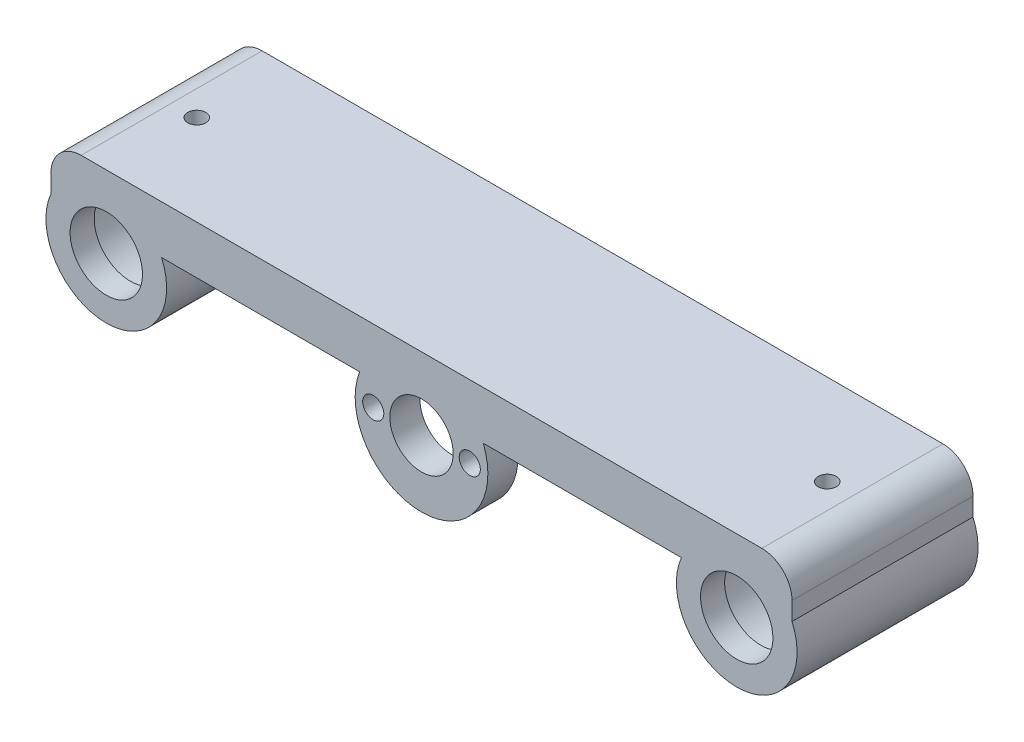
ISO-10303-21;
HEADER;
FILE_DESCRIPTION(('STEP AP214'),'2;1');
FILE_NAME('part.step','',(''),(''),'','','');
FILE_SCHEMA(('AUTOMOTIVE_DESIGN { 1 0 10303 214 1 1 1 1 }'));
ENDSEC;
DATA;
#1=APPLICATION_CONTEXT('core data for automotive mechanical design processes');
#2=APPLICATION_PROTOCOL_DEFINITION('international standard','automotive_design',2000,#1);
#3=PRODUCT_CONTEXT('',#1,'mechanical');
#4=PRODUCT('Part','Part','',(#3));
#5=PRODUCT_RELATED_PRODUCT_CATEGORY('part','',(#4));
#6=PRODUCT_DEFINITION_FORMATION('','',#4);
#7=PRODUCT_DEFINITION_CONTEXT('part definition',#1,'design');
#8=PRODUCT_DEFINITION('design','',#6,#7);
#9=PRODUCT_DEFINITION_SHAPE('','',#8);
#10=(LENGTH_UNIT() NAMED_UNIT(*) SI_UNIT(.MILLI.,.METRE.));
#11=(NAMED_UNIT(*) PLANE_ANGLE_UNIT() SI_UNIT($,.RADIAN.));
#12=(NAMED_UNIT(*) SI_UNIT($,.STERADIAN.) SOLID_ANGLE_UNIT());
#13=UNCERTAINTY_MEASURE_WITH_UNIT(LENGTH_MEASURE(1.E-05),#10,'distance_accuracy_value','');
#14=(GEOMETRIC_REPRESENTATION_CONTEXT(3) GLOBAL_UNCERTAINTY_ASSIGNED_CONTEXT((#13)) GLOBAL_UNIT_ASSIGNED_CONTEXT((#10,
#11,#12)) REPRESENTATION_CONTEXT('',''));
#15=CARTESIAN_POINT('',(0.,0.,0.));
#16=DIRECTION('',(0.,0.,1.));
#17=DIRECTION('',(1.,0.,0.));
#18=AXIS2_PLACEMENT_3D('',#15,#16,#17);
#19=CARTESIAN_POINT('',(52.25,0.,30.));
#20=DIRECTION('',(0.,0.,-1.));
#21=DIRECTION('',(-1.,0.,0.));
#22=AXIS2_PLACEMENT_3D('',#19,#20,#21);
#23=CYLINDRICAL_SURFACE('',#22,11.);
#24=CARTESIAN_POINT('',(52.25,0.,25.));
#25=DIRECTION('',(0.,0.,-1.));
#26=DIRECTION('',(-1.,0.,0.));
#27=AXIS2_PLACEMENT_3D('',#24,#25,#26);
#28=CIRCLE('',#27,11.);
#29=CARTESIAN_POINT('',(62.4969507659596,4.,25.));
#30=VERTEX_POINT('',#29);
#31=CARTESIAN_POINT('',(42.0030492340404,4.,25.));
#32=VERTEX_POINT('',#31);
#33=EDGE_CURVE('E132',#30,#32,#28,.T.);
#34=ORIENTED_EDGE('',*,*,#33,.F.);
#35=DIRECTION('',(0.,0.,-1.));
#36=VECTOR('',#35,1.);
#37=CARTESIAN_POINT('',(62.4969507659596,4.,30.));
#38=LINE('',#37,#36);
#39=CARTESIAN_POINT('',(62.4969507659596,4.,30.));
#40=VERTEX_POINT('',#39);
#41=EDGE_CURVE('E155',#40,#30,#38,.T.);
#42=ORIENTED_EDGE('',*,*,#41,.F.);
#43=CARTESIAN_POINT('',(52.25,0.,30.));
#44=DIRECTION('',(0.,0.,1.));
#45=DIRECTION('',(1.,0.,0.));
#46=AXIS2_PLACEMENT_3D('',#43,#44,#45);
#47=CIRCLE('',#46,11.);
#48=CARTESIAN_POINT('',(42.0030492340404,4.,30.));
#49=VERTEX_POINT('',#48);
#50=EDGE_CURVE('E153',#49,#40,#47,.T.);
#51=ORIENTED_EDGE('',*,*,#50,.F.);
#52=DIRECTION('',(0.,0.,-1.));
#53=VECTOR('',#52,1.);
#54=CARTESIAN_POINT('',(42.0030492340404,4.,30.));
#55=LINE('',#54,#53);
#56=EDGE_CURVE('E148',#49,#32,#55,.T.);
#57=ORIENTED_EDGE('',*,*,#56,.T.);
#58=EDGE_LOOP('',(#34,#42,#51,#57));
#59=FACE_BOUND('',#58,.T.);
#60=ADVANCED_FACE('F39',(#59),#23,.T.);
#61=CARTESIAN_POINT('',(60.25,0.,30.));
#62=DIRECTION('',(0.,0.,-1.));
#63=DIRECTION('',(-1.,0.,0.));
#64=AXIS2_PLACEMENT_3D('',#61,#62,#63);
#65=CYLINDRICAL_SURFACE('',#64,1.75);
#66=CARTESIAN_POINT('',(60.25,0.,30.));
#67=DIRECTION('',(0.,0.,1.));
#68=DIRECTION('',(1.,0.,0.));
#69=AXIS2_PLACEMENT_3D('',#66,#67,#68);
#70=CIRCLE('',#69,1.75);
#71=CARTESIAN_POINT('',(62.,0.,30.));
#72=VERTEX_POINT('',#71);
#73=EDGE_CURVE('E234',#72,#72,#70,.T.);
#74=ORIENTED_EDGE('',*,*,#73,.T.);
#75=EDGE_LOOP('',(#74));
#76=FACE_BOUND('',#75,.T.);
#77=CARTESIAN_POINT('',(60.25,0.,25.));
#78=DIRECTION('',(0.,0.,-1.));
#79=DIRECTION('',(-1.,0.,0.));
#80=AXIS2_PLACEMENT_3D('',#77,#78,#79);
#81=CIRCLE('',#80,1.75);
#82=CARTESIAN_POINT('',(58.5,0.,25.));
#83=VERTEX_POINT('',#82);
#84=EDGE_CURVE('E297',#83,#83,#81,.T.);
#85=ORIENTED_EDGE('',*,*,#84,.T.);
#86=EDGE_LOOP('',(#85));
#87=FACE_BOUND('',#86,.T.);
#88=ADVANCED_FACE('F348',(#76,#87),#65,.F.);
#89=CARTESIAN_POINT('',(44.25,0.,30.));
#90=DIRECTION('',(0.,0.,-1.));
#91=DIRECTION('',(-1.,0.,0.));
#92=AXIS2_PLACEMENT_3D('',#89,#90,#91);
#93=CYLINDRICAL_SURFACE('',#92,1.75);
#94=CARTESIAN_POINT('',(44.25,0.,30.));
#95=DIRECTION('',(0.,0.,1.));
#96=DIRECTION('',(1.,0.,0.));
#97=AXIS2_PLACEMENT_3D('',#94,#95,#96);
#98=CIRCLE('',#97,1.75);
#99=CARTESIAN_POINT('',(46.,0.,30.));
#100=VERTEX_POINT('',#99);
#101=EDGE_CURVE('E229',#100,#100,#98,.T.);
#102=ORIENTED_EDGE('',*,*,#101,.T.);
#103=EDGE_LOOP('',(#102));
#104=FACE_BOUND('',#103,.T.);
#105=CARTESIAN_POINT('',(44.25,0.,25.));
#106=DIRECTION('',(0.,0.,-1.));
#107=DIRECTION('',(-1.,0.,0.));
#108=AXIS2_PLACEMENT_3D('',#105,#106,#107);
#109=CIRCLE('',#108,1.75);
#110=CARTESIAN_POINT('',(42.5,0.,25.));
#111=VERTEX_POINT('',#110);
#112=EDGE_CURVE('E43',#111,#111,#109,.T.);
#113=ORIENTED_EDGE('',*,*,#112,.T.);
#114=EDGE_LOOP('',(#113));
#115=FACE_BOUND('',#114,.T.);
#116=ADVANCED_FACE('F353',(#104,#115),#93,.F.);
#117=CARTESIAN_POINT('',(104.5,0.,30.));
#118=DIRECTION('',(0.,0.,-1.));
#119=DIRECTION('',(-1.,0.,0.));
#120=AXIS2_PLACEMENT_3D('',#117,#118,#119);
#121=CYLINDRICAL_SURFACE('',#120,7.75);
#122=CARTESIAN_POINT('',(104.5,7.75,16.5));
#123=CARTESIAN_POINT('',(104.583421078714,7.74999847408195,16.4999968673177));
#124=CARTESIAN_POINT('',(104.666882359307,7.74863921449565,16.4930174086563));
#125=CARTESIAN_POINT('',(104.831449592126,7.74334791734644,16.4653039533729));
#126=CARTESIAN_POINT('',(104.912553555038,7.73941376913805,16.4445586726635));
#127=CARTESIAN_POINT('',(105.070002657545,7.72941240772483,16.3899753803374));
#128=CARTESIAN_POINT('',(105.146352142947,7.7233471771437,16.3561495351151));
#129=CARTESIAN_POINT('',(105.292285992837,7.70974455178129,16.2764006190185));
#130=CARTESIAN_POINT('',(105.361870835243,7.70220726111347,16.2304784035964));
#131=CARTESIAN_POINT('',(105.493191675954,7.6863840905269,16.1272204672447));
#132=CARTESIAN_POINT('',(105.554829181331,7.67809065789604,16.0697606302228));
#133=CARTESIAN_POINT('',(105.667653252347,7.66174545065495,15.9453254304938));
#134=CARTESIAN_POINT('',(105.718839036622,7.65369369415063,15.8783493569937));
#135=CARTESIAN_POINT('',(105.80972091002,7.63866991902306,15.7360809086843));
#136=CARTESIAN_POINT('',(105.849315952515,7.63170762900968,15.6607228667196));
#137=CARTESIAN_POINT('',(105.915245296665,7.61975791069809,15.5042668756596));
#138=CARTESIAN_POINT('',(105.941580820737,7.6147703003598,15.4231694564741));
#139=CARTESIAN_POINT('',(105.97992571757,7.60741086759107,15.2585934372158));
#140=CARTESIAN_POINT('',(105.992107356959,7.60500761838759,15.1751564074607));
#141=CARTESIAN_POINT('',(106.002333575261,7.60299433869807,15.0073908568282));
#142=CARTESIAN_POINT('',(106.000379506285,7.60338404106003,14.923062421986));
#143=CARTESIAN_POINT('',(105.982529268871,7.60688404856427,14.7571617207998));
#144=CARTESIAN_POINT('',(105.966829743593,7.60995597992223,14.6755673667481));
#145=CARTESIAN_POINT('',(105.92224426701,7.61841397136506,14.516192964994));
#146=CARTESIAN_POINT('',(105.893357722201,7.62380013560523,14.4384130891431));
#147=CARTESIAN_POINT('',(105.823028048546,7.63631940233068,14.2883042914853));
#148=CARTESIAN_POINT('',(105.781506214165,7.64346339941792,14.2160131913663));
#149=CARTESIAN_POINT('',(105.687140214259,7.65868628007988,14.0793505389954));
#150=CARTESIAN_POINT('',(105.634294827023,7.66676526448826,14.0149798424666));
#151=CARTESIAN_POINT('',(105.517725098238,7.68311457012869,13.8948497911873));
#152=CARTESIAN_POINT('',(105.453832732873,7.6913858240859,13.8392534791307));
#153=CARTESIAN_POINT('',(105.317543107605,7.70706304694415,13.7395427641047));
#154=CARTESIAN_POINT('',(105.245145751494,7.71446900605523,13.6954284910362));
#155=CARTESIAN_POINT('',(105.093725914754,7.72759765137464,13.6199071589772));
#156=CARTESIAN_POINT('',(105.014694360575,7.73331798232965,13.5885178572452));
#157=CARTESIAN_POINT('',(104.852344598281,7.74241280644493,13.5395066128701));
#158=CARTESIAN_POINT('',(104.769026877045,7.74578756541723,13.5218831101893));
#159=CARTESIAN_POINT('',(104.601871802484,7.74977424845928,13.5011325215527));
#160=CARTESIAN_POINT('',(104.518063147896,7.75042872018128,13.4977821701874));
#161=CARTESIAN_POINT('',(104.35108336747,7.74901892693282,13.5050729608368));
#162=CARTESIAN_POINT('',(104.267912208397,7.74695480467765,13.5157133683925));
#163=CARTESIAN_POINT('',(104.105282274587,7.7403663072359,13.5504980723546));
#164=CARTESIAN_POINT('',(104.025798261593,7.73586266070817,13.5745286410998));
#165=CARTESIAN_POINT('',(103.871987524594,7.72489811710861,13.6352878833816));
#166=CARTESIAN_POINT('',(103.797661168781,7.71843708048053,13.6720174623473));
#167=CARTESIAN_POINT('',(103.655328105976,7.7041683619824,13.7576209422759));
#168=CARTESIAN_POINT('',(103.58740437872,7.69634597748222,13.8066303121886));
#169=CARTESIAN_POINT('',(103.460665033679,7.68025855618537,13.9152197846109));
#170=CARTESIAN_POINT('',(103.401850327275,7.67199347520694,13.974800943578));
#171=CARTESIAN_POINT('',(103.294143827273,7.65580995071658,14.103856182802));
#172=CARTESIAN_POINT('',(103.24540483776,7.64789809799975,14.1734587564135));
#173=CARTESIAN_POINT('',(103.160309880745,7.63345275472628,14.3199942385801));
#174=CARTESIAN_POINT('',(103.123953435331,7.62691921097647,14.3969268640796));
#175=CARTESIAN_POINT('',(103.064868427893,7.61602267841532,14.5555629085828));
#176=CARTESIAN_POINT('',(103.042071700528,7.61164885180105,14.6372401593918));
#177=CARTESIAN_POINT('',(103.010544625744,7.60554305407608,14.8033588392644));
#178=CARTESIAN_POINT('',(103.001812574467,7.60381076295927,14.887799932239));
#179=CARTESIAN_POINT('',(102.998722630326,7.60320113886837,15.0555170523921));
#180=CARTESIAN_POINT('',(103.004123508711,7.60427589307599,15.1387885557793));
#181=CARTESIAN_POINT('',(103.028615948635,7.60905263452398,15.3032124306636));
#182=CARTESIAN_POINT('',(103.047707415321,7.61275460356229,15.3843648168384));
#183=CARTESIAN_POINT('',(103.098934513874,7.62234788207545,15.5421057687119));
#184=CARTESIAN_POINT('',(103.13104237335,7.62823452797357,15.6187036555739));
#185=CARTESIAN_POINT('',(103.207363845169,7.64153687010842,15.7654634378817));
#186=CARTESIAN_POINT('',(103.251578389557,7.64895268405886,15.8356248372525));
#187=CARTESIAN_POINT('',(103.351689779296,7.66462550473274,15.9687249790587));
#188=CARTESIAN_POINT('',(103.407761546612,7.67289403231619,16.0315308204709));
#189=CARTESIAN_POINT('',(103.529632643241,7.68925611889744,16.1469221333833));
#190=CARTESIAN_POINT('',(103.595434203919,7.69734963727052,16.1995052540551));
#191=CARTESIAN_POINT('',(103.73566215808,7.71254202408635,16.2934370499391));
#192=CARTESIAN_POINT('',(103.810165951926,7.71963049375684,16.3346719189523));
#193=CARTESIAN_POINT('',(103.965159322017,7.73191220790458,16.4039722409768));
#194=CARTESIAN_POINT('',(104.04564330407,7.73710719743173,16.4320498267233));
#195=CARTESIAN_POINT('',(104.188614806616,7.74398117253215,16.4686625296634));
#196=CARTESIAN_POINT('',(104.250276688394,7.74622526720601,16.4803935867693));
#197=CARTESIAN_POINT('',(104.374618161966,7.74923523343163,16.4960633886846));
#198=CARTESIAN_POINT('',(104.437297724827,7.75000114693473,16.5000023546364));
#199=CARTESIAN_POINT('',(104.5,7.75,16.5));
#200=B_SPLINE_CURVE_WITH_KNOTS('',3,(#122,#123,#124,#125,#126,#127,#128,#129,#130,#131,#132,
#133,#134,#135,#136,#137,#138,#139,#140,#141,#142,#143,#144,#145,#146,#147,#148,#149,#150,#151,
#152,#153,#154,#155,#156,#157,#158,#159,#160,#161,#162,#163,#164,#165,#166,#167,#168,#169,#170,
#171,#172,#173,#174,#175,#176,#177,#178,#179,#180,#181,#182,#183,#184,#185,#186,#187,#188,#189,
#190,#191,#192,#193,#194,#195,#196,#197,#198,#199),.UNSPECIFIED.,.T.,.F.,(4,2,2,2,2,2,2,2,2,2,2,
2,2,2,2,2,2,2,2,2,2,2,2,2,2,2,2,2,2,2,2,2,2,2,2,2,2,2,4),(0.,0.250033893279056,0.50027299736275,
0.750279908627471,1.00026914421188,1.25310753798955,1.5059648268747,1.76096497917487,
2.01594161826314,2.26778131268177,2.51959691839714,2.76786784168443,3.01614993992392,
3.26601139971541,3.51589983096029,3.7699911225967,4.02408528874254,4.27853282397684,
4.53295151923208,4.78337555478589,5.03378644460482,5.28210222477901,5.53043571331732,
5.78163969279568,6.03286878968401,6.28766619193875,6.5424537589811,6.7959494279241,
7.04941438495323,7.29858139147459,7.54774667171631,7.79638309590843,8.045038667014,
8.29765636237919,8.5503320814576,8.80545637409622,9.06034494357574,9.24828472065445,
9.43621916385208),.UNSPECIFIED.);
#201=CARTESIAN_POINT('',(104.5,7.75,16.5));
#202=VERTEX_POINT('',#201);
#203=EDGE_CURVE('E270',#202,#202,#200,.T.);
#204=ORIENTED_EDGE('',*,*,#203,.T.);
#205=EDGE_LOOP('',(#204));
#206=FACE_BOUND('',#205,.T.);
#207=CARTESIAN_POINT('',(104.5,0.,0.));
#208=DIRECTION('',(0.,0.,1.));
#209=DIRECTION('',(1.,0.,0.));
#210=AXIS2_PLACEMENT_3D('',#207,#208,#209);
#211=CIRCLE('',#210,7.75);
#212=CARTESIAN_POINT('',(112.25,0.,0.));
#213=VERTEX_POINT('',#212);
#214=EDGE_CURVE('E219',#213,#213,#211,.T.);
#215=ORIENTED_EDGE('',*,*,#214,.F.);
#216=EDGE_LOOP('',(#215));
#217=FACE_BOUND('',#216,.T.);
#218=CARTESIAN_POINT('',(104.5,0.,26.));
#219=DIRECTION('',(0.,0.,1.));
#220=DIRECTION('',(1.,0.,0.));
#221=AXIS2_PLACEMENT_3D('',#218,#219,#220);
#222=CIRCLE('',#221,7.74999999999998);
#223=CARTESIAN_POINT('',(112.25,0.,26.));
#224=VERTEX_POINT('',#223);
#225=EDGE_CURVE('E264',#224,#224,#222,.T.);
#226=ORIENTED_EDGE('',*,*,#225,.T.);
#227=EDGE_LOOP('',(#226));
#228=FACE_BOUND('',#227,.T.);
#229=ADVANCED_FACE('F370',(#206,#217,#228),#121,.F.);
#230=CARTESIAN_POINT('',(0.,0.,30.));
#231=DIRECTION('',(0.,0.,-1.));
#232=DIRECTION('',(-1.,0.,0.));
#233=AXIS2_PLACEMENT_3D('',#230,#231,#232);
#234=CYLINDRICAL_SURFACE('',#233,7.75);
#235=CARTESIAN_POINT('',(0.,7.75,16.5));
#236=CARTESIAN_POINT('',(0.0834210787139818,7.74999847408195,16.4999968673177));
#237=CARTESIAN_POINT('',(0.166882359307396,7.74863921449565,16.4930174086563));
#238=CARTESIAN_POINT('',(0.331449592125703,7.74334791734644,16.4653039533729));
#239=CARTESIAN_POINT('',(0.412553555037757,7.73941376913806,16.4445586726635));
#240=CARTESIAN_POINT('',(0.570002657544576,7.72941240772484,16.3899753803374));
#241=CARTESIAN_POINT('',(0.64635214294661,7.7233471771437,16.3561495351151));
#242=CARTESIAN_POINT('',(0.792285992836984,7.70974455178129,16.2764006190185));
#243=CARTESIAN_POINT('',(0.861870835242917,7.70220726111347,16.2304784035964));
#244=CARTESIAN_POINT('',(0.99319167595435,7.6863840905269,16.1272204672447));
#245=CARTESIAN_POINT('',(1.05482918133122,7.67809065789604,16.0697606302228));
#246=CARTESIAN_POINT('',(1.16765325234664,7.66174545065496,15.9453254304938));
#247=CARTESIAN_POINT('',(1.2188390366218,7.65369369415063,15.8783493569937));
#248=CARTESIAN_POINT('',(1.30972091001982,7.63866991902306,15.7360809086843));
#249=CARTESIAN_POINT('',(1.3493159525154,7.63170762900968,15.6607228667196));
#250=CARTESIAN_POINT('',(1.41524529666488,7.61975791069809,15.5042668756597));
#251=CARTESIAN_POINT('',(1.44158082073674,7.6147703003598,15.4231694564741));
#252=CARTESIAN_POINT('',(1.47992571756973,7.60741086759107,15.2585934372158));
#253=CARTESIAN_POINT('',(1.49210735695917,7.60500761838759,15.1751564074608));
#254=CARTESIAN_POINT('',(1.50233357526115,7.60299433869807,15.0073908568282));
#255=CARTESIAN_POINT('',(1.50037950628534,7.60338404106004,14.923062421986));
#256=CARTESIAN_POINT('',(1.48252926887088,7.60688404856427,14.7571617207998));
#257=CARTESIAN_POINT('',(1.46682974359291,7.60995597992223,14.6755673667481));
#258=CARTESIAN_POINT('',(1.42224426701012,7.61841397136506,14.516192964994));
#259=CARTESIAN_POINT('',(1.39335772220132,7.62380013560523,14.4384130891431));
#260=CARTESIAN_POINT('',(1.32302804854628,7.63631940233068,14.2883042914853));
#261=CARTESIAN_POINT('',(1.28150621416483,7.64346339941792,14.2160131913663));
#262=CARTESIAN_POINT('',(1.18714021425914,7.65868628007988,14.0793505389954));
#263=CARTESIAN_POINT('',(1.13429482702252,7.66676526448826,14.0149798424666));
#264=CARTESIAN_POINT('',(1.01772509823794,7.68311457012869,13.8948497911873));
#265=CARTESIAN_POINT('',(0.953832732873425,7.6913858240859,13.8392534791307));
#266=CARTESIAN_POINT('',(0.817543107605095,7.70706304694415,13.7395427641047));
#267=CARTESIAN_POINT('',(0.745145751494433,7.71446900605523,13.6954284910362));
#268=CARTESIAN_POINT('',(0.593725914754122,7.72759765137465,13.6199071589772));
#269=CARTESIAN_POINT('',(0.514694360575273,7.73331798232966,13.5885178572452));
#270=CARTESIAN_POINT('',(0.352344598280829,7.74241280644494,13.5395066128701));
#271=CARTESIAN_POINT('',(0.269026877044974,7.74578756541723,13.5218831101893));
#272=CARTESIAN_POINT('',(0.101871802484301,7.74977424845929,13.5011325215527));
#273=CARTESIAN_POINT('',(0.018063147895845,7.75042872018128,13.4977821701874));
#274=CARTESIAN_POINT('',(-0.148916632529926,7.74901892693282,13.5050729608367));
#275=CARTESIAN_POINT('',(-0.232087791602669,7.74695480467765,13.5157133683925));
#276=CARTESIAN_POINT('',(-0.394717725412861,7.7403663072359,13.5504980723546));
#277=CARTESIAN_POINT('',(-0.474201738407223,7.73586266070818,13.5745286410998));
#278=CARTESIAN_POINT('',(-0.628012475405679,7.72489811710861,13.6352878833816));
#279=CARTESIAN_POINT('',(-0.702338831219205,7.71843708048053,13.6720174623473));
#280=CARTESIAN_POINT('',(-0.844671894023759,7.7041683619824,13.7576209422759));
#281=CARTESIAN_POINT('',(-0.912595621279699,7.69634597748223,13.8066303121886));
#282=CARTESIAN_POINT('',(-1.03933496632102,7.68025855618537,13.9152197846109));
#283=CARTESIAN_POINT('',(-1.09814967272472,7.67199347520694,13.974800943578));
#284=CARTESIAN_POINT('',(-1.20585617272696,7.65580995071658,14.103856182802));
#285=CARTESIAN_POINT('',(-1.25459516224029,7.64789809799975,14.1734587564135));
#286=CARTESIAN_POINT('',(-1.33969011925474,7.63345275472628,14.3199942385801));
#287=CARTESIAN_POINT('',(-1.37604656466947,7.62691921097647,14.3969268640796));
#288=CARTESIAN_POINT('',(-1.43513157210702,7.61602267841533,14.5555629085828));
#289=CARTESIAN_POINT('',(-1.45792829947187,7.61164885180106,14.6372401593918));
#290=CARTESIAN_POINT('',(-1.48945537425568,7.60554305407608,14.8033588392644));
#291=CARTESIAN_POINT('',(-1.49818742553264,7.60381076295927,14.887799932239));
#292=CARTESIAN_POINT('',(-1.50127736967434,7.60320113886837,15.0555170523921));
#293=CARTESIAN_POINT('',(-1.49587649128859,7.60427589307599,15.1387885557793));
#294=CARTESIAN_POINT('',(-1.47138405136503,7.60905263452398,15.3032124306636));
#295=CARTESIAN_POINT('',(-1.45229258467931,7.61275460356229,15.3843648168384));
#296=CARTESIAN_POINT('',(-1.40106548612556,7.62234788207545,15.5421057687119));
#297=CARTESIAN_POINT('',(-1.36895762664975,7.62823452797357,15.6187036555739));
#298=CARTESIAN_POINT('',(-1.29263615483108,7.64153687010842,15.7654634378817));
#299=CARTESIAN_POINT('',(-1.24842161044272,7.64895268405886,15.8356248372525));
#300=CARTESIAN_POINT('',(-1.14831022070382,7.66462550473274,15.9687249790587));
#301=CARTESIAN_POINT('',(-1.09223845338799,7.67289403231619,16.0315308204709));
#302=CARTESIAN_POINT('',(-0.970367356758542,7.68925611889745,16.1469221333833));
#303=CARTESIAN_POINT('',(-0.904565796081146,7.69734963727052,16.1995052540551));
#304=CARTESIAN_POINT('',(-0.764337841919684,7.71254202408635,16.2934370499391));
#305=CARTESIAN_POINT('',(-0.689834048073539,7.71963049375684,16.3346719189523));
#306=CARTESIAN_POINT('',(-0.534840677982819,7.73191220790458,16.4039722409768));
#307=CARTESIAN_POINT('',(-0.454356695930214,7.73710719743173,16.4320498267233));
#308=CARTESIAN_POINT('',(-0.311385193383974,7.74398117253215,16.4686625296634));
#309=CARTESIAN_POINT('',(-0.249723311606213,7.74622526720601,16.4803935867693));
#310=CARTESIAN_POINT('',(-0.125381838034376,7.74923523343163,16.4960633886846));
#311=CARTESIAN_POINT('',(-0.0627022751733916,7.75000114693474,16.5000023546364));
#312=CARTESIAN_POINT('',(0.,7.75,16.5));
#313=B_SPLINE_CURVE_WITH_KNOTS('',3,(#235,#236,#237,#238,#239,#240,#241,#242,#243,#244,#245,
#246,#247,#248,#249,#250,#251,#252,#253,#254,#255,#256,#257,#258,#259,#260,#261,#262,#263,#264,
#265,#266,#267,#268,#269,#270,#271,#272,#273,#274,#275,#276,#277,#278,#279,#280,#281,#282,#283,
#284,#285,#286,#287,#288,#289,#290,#291,#292,#293,#294,#295,#296,#297,#298,#299,#300,#301,#302,
#303,#304,#305,#306,#307,#308,#309,#310,#311,#312),.UNSPECIFIED.,.T.,.F.,(4,2,2,2,2,2,2,2,2,2,2,
2,2,2,2,2,2,2,2,2,2,2,2,2,2,2,2,2,2,2,2,2,2,2,2,2,2,2,4),(0.,0.250033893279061,
0.500272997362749,0.75027990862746,1.00026914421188,1.25310753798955,1.5059648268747,
1.76096497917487,2.01594161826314,2.26778131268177,2.51959691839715,2.76786784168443,
3.01614993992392,3.26601139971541,3.51589983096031,3.76999112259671,4.02408528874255,
4.27853282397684,4.53295151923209,4.78337555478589,5.03378644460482,5.28210222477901,
5.53043571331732,5.78163969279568,6.03286878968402,6.28766619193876,6.5424537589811,
6.79594942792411,7.04941438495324,7.2985813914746,7.54774667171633,7.79638309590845,
8.04503866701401,8.29765636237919,8.55033208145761,8.80545637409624,9.06034494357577,
9.24828472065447,9.4362191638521),.UNSPECIFIED.);
#314=CARTESIAN_POINT('',(0.,7.75,16.5));
#315=VERTEX_POINT('',#314);
#316=EDGE_CURVE('E278',#315,#315,#313,.T.);
#317=ORIENTED_EDGE('',*,*,#316,.T.);
#318=EDGE_LOOP('',(#317));
#319=FACE_BOUND('',#318,.T.);
#320=CARTESIAN_POINT('',(0.,0.,0.));
#321=DIRECTION('',(0.,0.,1.));
#322=DIRECTION('',(1.,0.,0.));
#323=AXIS2_PLACEMENT_3D('',#320,#321,#322);
#324=CIRCLE('',#323,7.75);
#325=CARTESIAN_POINT('',(7.75,0.,0.));
#326=VERTEX_POINT('',#325);
#327=EDGE_CURVE('E222',#326,#326,#324,.T.);
#328=ORIENTED_EDGE('',*,*,#327,.F.);
#329=EDGE_LOOP('',(#328));
#330=FACE_BOUND('',#329,.T.);
#331=CARTESIAN_POINT('',(0.,0.,26.));
#332=DIRECTION('',(0.,0.,1.));
#333=DIRECTION('',(1.,0.,0.));
#334=AXIS2_PLACEMENT_3D('',#331,#332,#333);
#335=CIRCLE('',#334,7.75);
#336=CARTESIAN_POINT('',(7.75,0.,26.));
#337=VERTEX_POINT('',#336);
#338=EDGE_CURVE('E208',#337,#337,#335,.T.);
#339=ORIENTED_EDGE('',*,*,#338,.T.);
#340=EDGE_LOOP('',(#339));
#341=FACE_BOUND('',#340,.T.);
#342=ADVANCED_FACE('F366',(#319,#330,#341),#234,.F.);
#343=CARTESIAN_POINT('',(104.5,0.,30.));
#344=DIRECTION('',(0.,0.,-1.));
#345=DIRECTION('',(-1.,0.,0.));
#346=AXIS2_PLACEMENT_3D('',#343,#344,#345);
#347=CYLINDRICAL_SURFACE('',#346,9.99999999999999);
#348=CARTESIAN_POINT('',(104.5,0.,0.));
#349=DIRECTION('',(0.,0.,1.));
#350=DIRECTION('',(1.,0.,0.));
#351=AXIS2_PLACEMENT_3D('',#348,#349,#350);
#352=CIRCLE('',#351,9.99999999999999);
#353=CARTESIAN_POINT('',(95.3348486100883,4.,0.));
#354=VERTEX_POINT('',#353);
#355=CARTESIAN_POINT('',(113.665151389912,4.,0.));
#356=VERTEX_POINT('',#355);
#357=EDGE_CURVE('E204',#354,#356,#352,.T.);
#358=ORIENTED_EDGE('',*,*,#357,.T.);
#359=DIRECTION('',(0.,0.,-1.));
#360=VECTOR('',#359,1.);
#361=CARTESIAN_POINT('',(113.665151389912,4.,30.));
#362=LINE('',#361,#360);
#363=CARTESIAN_POINT('',(113.665151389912,4.,30.));
#364=VERTEX_POINT('',#363);
#365=EDGE_CURVE('E165',#364,#356,#362,.T.);
#366=ORIENTED_EDGE('',*,*,#365,.F.);
#367=CARTESIAN_POINT('',(104.5,0.,30.));
#368=DIRECTION('',(0.,0.,1.));
#369=DIRECTION('',(1.,0.,0.));
#370=AXIS2_PLACEMENT_3D('',#367,#368,#369);
#371=CIRCLE('',#370,9.99999999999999);
#372=CARTESIAN_POINT('',(95.3348486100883,4.,30.));
#373=VERTEX_POINT('',#372);
#374=EDGE_CURVE('E227',#373,#364,#371,.T.);
#375=ORIENTED_EDGE('',*,*,#374,.F.);
#376=DIRECTION('',(0.,0.,-1.));
#377=VECTOR('',#376,1.);
#378=CARTESIAN_POINT('',(95.3348486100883,4.,30.));
#379=LINE('',#378,#377);
#380=EDGE_CURVE('E160',#373,#354,#379,.T.);
#381=ORIENTED_EDGE('',*,*,#380,.T.);
#382=EDGE_LOOP('',(#358,#366,#375,#381));
#383=FACE_BOUND('',#382,.T.);
#384=ADVANCED_FACE('F328',(#383),#347,.T.);
#385=CARTESIAN_POINT('',(113.665151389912,0.,30.));
#386=DIRECTION('',(-1.,0.,0.));
#387=DIRECTION('',(0.,0.,1.));
#388=AXIS2_PLACEMENT_3D('',#385,#386,#387);
#389=PLANE('',#388);
#390=DIRECTION('',(0.,1.,0.));
#391=VECTOR('',#390,1.);
#392=CARTESIAN_POINT('',(113.665151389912,0.,0.));
#393=LINE('',#392,#391);
#394=CARTESIAN_POINT('',(113.665151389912,7.,0.));
#395=VERTEX_POINT('',#394);
#396=EDGE_CURVE('E199',#356,#395,#393,.T.);
#397=ORIENTED_EDGE('',*,*,#396,.T.);
#398=DIRECTION('',(0.,0.,-1.));
#399=VECTOR('',#398,1.);
#400=CARTESIAN_POINT('',(113.665151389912,7.,30.));
#401=LINE('',#400,#399);
#402=CARTESIAN_POINT('',(113.665151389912,7.,30.));
#403=VERTEX_POINT('',#402);
#404=EDGE_CURVE('E63',#395,#403,#401,.F.);
#405=ORIENTED_EDGE('',*,*,#404,.T.);
#406=DIRECTION('',(0.,1.,0.));
#407=VECTOR('',#406,1.);
#408=CARTESIAN_POINT('',(113.665151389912,0.,30.));
#409=LINE('',#408,#407);
#410=EDGE_CURVE('E185',#364,#403,#409,.T.);
#411=ORIENTED_EDGE('',*,*,#410,.F.);
#412=ORIENTED_EDGE('',*,*,#365,.T.);
#413=EDGE_LOOP('',(#397,#405,#411,#412));
#414=FACE_BOUND('',#413,.T.);
#415=ADVANCED_FACE('F201',(#414),#389,.F.);
#416=CARTESIAN_POINT('',(0.,12.,30.));
#417=DIRECTION('',(0.,1.,0.));
#418=DIRECTION('',(0.,0.,1.));
#419=AXIS2_PLACEMENT_3D('',#416,#417,#418);
#420=PLANE('',#419);
#421=CARTESIAN_POINT('',(0.,12.,15.));
#422=DIRECTION('',(0.,1.,0.));
#423=DIRECTION('',(0.,0.,1.));
#424=AXIS2_PLACEMENT_3D('',#421,#422,#423);
#425=CIRCLE('',#424,1.5);
#426=CARTESIAN_POINT('',(0.,12.,16.5));
#427=VERTEX_POINT('',#426);
#428=EDGE_CURVE('E269',#427,#427,#425,.T.);
#429=ORIENTED_EDGE('',*,*,#428,.F.);
#430=EDGE_LOOP('',(#429));
#431=FACE_BOUND('',#430,.T.);
#432=CARTESIAN_POINT('',(104.5,12.,15.));
#433=DIRECTION('',(0.,1.,0.));
#434=DIRECTION('',(0.,0.,1.));
#435=AXIS2_PLACEMENT_3D('',#432,#433,#434);
#436=CIRCLE('',#435,1.5);
#437=CARTESIAN_POINT('',(104.5,12.,16.5));
#438=VERTEX_POINT('',#437);
#439=EDGE_CURVE('E279',#438,#438,#436,.T.);
#440=ORIENTED_EDGE('',*,*,#439,.F.);
#441=EDGE_LOOP('',(#440));
#442=FACE_BOUND('',#441,.T.);
#443=DIRECTION('',(1.,0.,0.));
#444=VECTOR('',#443,1.);
#445=CARTESIAN_POINT('',(0.,12.,30.));
#446=LINE('',#445,#444);
#447=CARTESIAN_POINT('',(-4.16515138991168,12.,30.));
#448=VERTEX_POINT('',#447);
#449=CARTESIAN_POINT('',(108.665151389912,12.,30.));
#450=VERTEX_POINT('',#449);
#451=EDGE_CURVE('E183',#448,#450,#446,.T.);
#452=ORIENTED_EDGE('',*,*,#451,.T.);
#453=DIRECTION('',(0.,0.,-1.));
#454=VECTOR('',#453,1.);
#455=CARTESIAN_POINT('',(108.665151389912,12.,0.));
#456=LINE('',#455,#454);
#457=CARTESIAN_POINT('',(108.665151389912,12.,0.));
#458=VERTEX_POINT('',#457);
#459=EDGE_CURVE('E170',#450,#458,#456,.T.);
#460=ORIENTED_EDGE('',*,*,#459,.T.);
#461=DIRECTION('',(1.,0.,0.));
#462=VECTOR('',#461,1.);
#463=CARTESIAN_POINT('',(0.,12.,0.));
#464=LINE('',#463,#462);
#465=CARTESIAN_POINT('',(-4.16515138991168,12.,0.));
#466=VERTEX_POINT('',#465);
#467=EDGE_CURVE('E200',#466,#458,#464,.T.);
#468=ORIENTED_EDGE('',*,*,#467,.F.);
#469=DIRECTION('',(0.,0.,-1.));
#470=VECTOR('',#469,1.);
#471=CARTESIAN_POINT('',(-4.16515138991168,12.,30.));
#472=LINE('',#471,#470);
#473=EDGE_CURVE('E168',#466,#448,#472,.F.);
#474=ORIENTED_EDGE('',*,*,#473,.T.);
#475=EDGE_LOOP('',(#452,#460,#468,#474));
#476=FACE_BOUND('',#475,.T.);
#477=ADVANCED_FACE('F189',(#431,#442,#476),#420,.T.);
#478=CARTESIAN_POINT('',(-9.16515138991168,0.,30.));
#479=DIRECTION('',(-1.,0.,0.));
#480=DIRECTION('',(0.,0.,1.));
#481=AXIS2_PLACEMENT_3D('',#478,#479,#480);
#482=PLANE('',#481);
#483=DIRECTION('',(0.,1.,0.));
#484=VECTOR('',#483,1.);
#485=CARTESIAN_POINT('',(-9.16515138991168,0.,30.));
#486=LINE('',#485,#484);
#487=CARTESIAN_POINT('',(-9.16515138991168,4.,30.));
#488=VERTEX_POINT('',#487);
#489=CARTESIAN_POINT('',(-9.16515138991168,7.,30.));
#490=VERTEX_POINT('',#489);
#491=EDGE_CURVE('E193',#488,#490,#486,.T.);
#492=ORIENTED_EDGE('',*,*,#491,.T.);
#493=DIRECTION('',(0.,0.,-1.));
#494=VECTOR('',#493,1.);
#495=CARTESIAN_POINT('',(-9.16515138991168,7.,30.));
#496=LINE('',#495,#494);
#497=CARTESIAN_POINT('',(-9.16515138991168,7.,0.));
#498=VERTEX_POINT('',#497);
#499=EDGE_CURVE('E11',#490,#498,#496,.T.);
#500=ORIENTED_EDGE('',*,*,#499,.T.);
#501=DIRECTION('',(0.,1.,0.));
#502=VECTOR('',#501,1.);
#503=CARTESIAN_POINT('',(-9.16515138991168,0.,0.));
#504=LINE('',#503,#502);
#505=CARTESIAN_POINT('',(-9.16515138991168,4.,0.));
#506=VERTEX_POINT('',#505);
#507=EDGE_CURVE('E206',#506,#498,#504,.T.);
#508=ORIENTED_EDGE('',*,*,#507,.F.);
#509=DIRECTION('',(0.,0.,-1.));
#510=VECTOR('',#509,1.);
#511=CARTESIAN_POINT('',(-9.16515138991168,4.,30.));
#512=LINE('',#511,#510);
#513=EDGE_CURVE('E158',#488,#506,#512,.T.);
#514=ORIENTED_EDGE('',*,*,#513,.F.);
#515=EDGE_LOOP('',(#492,#500,#508,#514));
#516=FACE_BOUND('',#515,.T.);
#517=ADVANCED_FACE('F305',(#516),#482,.T.);
#518=CARTESIAN_POINT('',(0.,0.,30.));
#519=DIRECTION('',(0.,0.,-1.));
#520=DIRECTION('',(-1.,0.,0.));
#521=AXIS2_PLACEMENT_3D('',#518,#519,#520);
#522=CYLINDRICAL_SURFACE('',#521,10.);
#523=CARTESIAN_POINT('',(0.,0.,0.));
#524=DIRECTION('',(0.,0.,1.));
#525=DIRECTION('',(1.,0.,0.));
#526=AXIS2_PLACEMENT_3D('',#523,#524,#525);
#527=CIRCLE('',#526,10.);
#528=CARTESIAN_POINT('',(9.16515138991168,4.,0.));
#529=VERTEX_POINT('',#528);
#530=EDGE_CURVE('E214',#506,#529,#527,.T.);
#531=ORIENTED_EDGE('',*,*,#530,.T.);
#532=DIRECTION('',(0.,0.,-1.));
#533=VECTOR('',#532,1.);
#534=CARTESIAN_POINT('',(9.16515138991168,4.,30.));
#535=LINE('',#534,#533);
#536=CARTESIAN_POINT('',(9.16515138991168,4.,30.));
#537=VERTEX_POINT('',#536);
#538=EDGE_CURVE('E154',#537,#529,#535,.T.);
#539=ORIENTED_EDGE('',*,*,#538,.F.);
#540=CARTESIAN_POINT('',(0.,0.,30.));
#541=DIRECTION('',(0.,0.,1.));
#542=DIRECTION('',(1.,0.,0.));
#543=AXIS2_PLACEMENT_3D('',#540,#541,#542);
#544=CIRCLE('',#543,10.);
#545=EDGE_CURVE('E247',#488,#537,#544,.T.);
#546=ORIENTED_EDGE('',*,*,#545,.F.);
#547=ORIENTED_EDGE('',*,*,#513,.T.);
#548=EDGE_LOOP('',(#531,#539,#546,#547));
#549=FACE_BOUND('',#548,.T.);
#550=ADVANCED_FACE('F333',(#549),#522,.T.);
#551=CARTESIAN_POINT('',(0.,4.,30.));
#552=DIRECTION('',(0.,1.,0.));
#553=DIRECTION('',(0.,0.,1.));
#554=AXIS2_PLACEMENT_3D('',#551,#552,#553);
#555=PLANE('',#554);
#556=DIRECTION('',(1.,0.,0.));
#557=VECTOR('',#556,1.);
#558=CARTESIAN_POINT('',(0.,4.,0.));
#559=LINE('',#558,#557);
#560=CARTESIAN_POINT('',(48.8496323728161,4.,0.));
#561=VERTEX_POINT('',#560);
#562=EDGE_CURVE('E216',#529,#561,#559,.T.);
#563=ORIENTED_EDGE('',*,*,#562,.T.);
#564=DIRECTION('',(0.,0.,-1.));
#565=VECTOR('',#564,1.);
#566=CARTESIAN_POINT('',(48.8496323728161,4.,30.));
#567=LINE('',#566,#565);
#568=CARTESIAN_POINT('',(48.8496323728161,4.,25.));
#569=VERTEX_POINT('',#568);
#570=EDGE_CURVE('E151',#561,#569,#567,.F.);
#571=ORIENTED_EDGE('',*,*,#570,.T.);
#572=DIRECTION('',(1.,0.,0.));
#573=VECTOR('',#572,1.);
#574=CARTESIAN_POINT('',(62.4969507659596,4.,25.));
#575=LINE('',#574,#573);
#576=EDGE_CURVE('E135',#32,#569,#575,.T.);
#577=ORIENTED_EDGE('',*,*,#576,.F.);
#578=ORIENTED_EDGE('',*,*,#56,.F.);
#579=DIRECTION('',(1.,0.,0.));
#580=VECTOR('',#579,1.);
#581=CARTESIAN_POINT('',(0.,4.,30.));
#582=LINE('',#581,#580);
#583=EDGE_CURVE('E245',#537,#49,#582,.T.);
#584=ORIENTED_EDGE('',*,*,#583,.F.);
#585=ORIENTED_EDGE('',*,*,#538,.T.);
#586=EDGE_LOOP('',(#563,#571,#577,#578,#584,#585));
#587=FACE_BOUND('',#586,.T.);
#588=ADVANCED_FACE('F146',(#587),#555,.F.);
#589=CARTESIAN_POINT('',(52.25,0.,30.));
#590=DIRECTION('',(0.,0.,-1.));
#591=DIRECTION('',(-1.,0.,0.));
#592=AXIS2_PLACEMENT_3D('',#589,#590,#591);
#593=CYLINDRICAL_SURFACE('',#592,5.25);
#594=DIRECTION('',(0.,0.,-1.));
#595=VECTOR('',#594,1.);
#596=CARTESIAN_POINT('',(55.6503676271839,4.,30.));
#597=LINE('',#596,#595);
#598=CARTESIAN_POINT('',(55.6503676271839,4.,25.));
#599=VERTEX_POINT('',#598);
#600=CARTESIAN_POINT('',(55.6503676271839,4.,0.));
#601=VERTEX_POINT('',#600);
#602=EDGE_CURVE('E317',#599,#601,#597,.T.);
#603=ORIENTED_EDGE('',*,*,#602,.F.);
#604=CARTESIAN_POINT('',(52.25,0.,25.));
#605=DIRECTION('',(0.,0.,-1.));
#606=DIRECTION('',(-1.,0.,0.));
#607=AXIS2_PLACEMENT_3D('',#604,#605,#606);
#608=CIRCLE('',#607,5.25);
#609=EDGE_CURVE('E311',#599,#569,#608,.T.);
#610=ORIENTED_EDGE('',*,*,#609,.T.);
#611=ORIENTED_EDGE('',*,*,#570,.F.);
#612=CARTESIAN_POINT('',(52.25,0.,0.));
#613=DIRECTION('',(0.,0.,1.));
#614=DIRECTION('',(1.,0.,0.));
#615=AXIS2_PLACEMENT_3D('',#612,#613,#614);
#616=CIRCLE('',#615,5.25);
#617=EDGE_CURVE('E225',#601,#561,#616,.T.);
#618=ORIENTED_EDGE('',*,*,#617,.F.);
#619=EDGE_LOOP('',(#603,#610,#611,#618));
#620=FACE_BOUND('',#619,.T.);
#621=CARTESIAN_POINT('',(52.25,0.,30.));
#622=DIRECTION('',(0.,0.,1.));
#623=DIRECTION('',(1.,0.,0.));
#624=AXIS2_PLACEMENT_3D('',#621,#622,#623);
#625=CIRCLE('',#624,5.25);
#626=CARTESIAN_POINT('',(57.5,0.,30.));
#627=VERTEX_POINT('',#626);
#628=EDGE_CURVE('E238',#627,#627,#625,.T.);
#629=ORIENTED_EDGE('',*,*,#628,.T.);
#630=EDGE_LOOP('',(#629));
#631=FACE_BOUND('',#630,.T.);
#632=ADVANCED_FACE('F324',(#620,#631),#593,.F.);
#633=EDGE_CURVE('E218',#601,#354,#559,.T.);
#634=ORIENTED_EDGE('',*,*,#633,.T.);
#635=ORIENTED_EDGE('',*,*,#380,.F.);
#636=EDGE_CURVE('E243',#40,#373,#582,.T.);
#637=ORIENTED_EDGE('',*,*,#636,.F.);
#638=ORIENTED_EDGE('',*,*,#41,.T.);
#639=EDGE_CURVE('E138',#599,#30,#575,.T.);
#640=ORIENTED_EDGE('',*,*,#639,.F.);
#641=ORIENTED_EDGE('',*,*,#602,.T.);
#642=EDGE_LOOP('',(#634,#635,#637,#638,#640,#641));
#643=FACE_BOUND('',#642,.T.);
#644=ADVANCED_FACE('F323',(#643),#555,.F.);
#645=CARTESIAN_POINT('',(0.,0.,30.));
#646=DIRECTION('',(0.,0.,1.));
#647=DIRECTION('',(1.,0.,0.));
#648=AXIS2_PLACEMENT_3D('',#645,#646,#647);
#649=PLANE('',#648);
#650=ORIENTED_EDGE('',*,*,#410,.T.);
#651=CARTESIAN_POINT('',(108.665151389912,7.,30.));
#652=DIRECTION('',(0.,0.,1.));
#653=DIRECTION('',(1.,0.,0.));
#654=AXIS2_PLACEMENT_3D('',#651,#652,#653);
#655=CIRCLE('',#654,5.);
#656=EDGE_CURVE('E48',#403,#450,#655,.T.);
#657=ORIENTED_EDGE('',*,*,#656,.T.);
#658=ORIENTED_EDGE('',*,*,#451,.F.);
#659=CARTESIAN_POINT('',(-4.16515138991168,7.,30.));
#660=DIRECTION('',(0.,0.,1.));
#661=DIRECTION('',(1.,0.,0.));
#662=AXIS2_PLACEMENT_3D('',#659,#660,#661);
#663=CIRCLE('',#662,5.);
#664=EDGE_CURVE('E55',#448,#490,#663,.T.);
#665=ORIENTED_EDGE('',*,*,#664,.T.);
#666=ORIENTED_EDGE('',*,*,#491,.F.);
#667=ORIENTED_EDGE('',*,*,#545,.T.);
#668=ORIENTED_EDGE('',*,*,#583,.T.);
#669=ORIENTED_EDGE('',*,*,#50,.T.);
#670=ORIENTED_EDGE('',*,*,#636,.T.);
#671=ORIENTED_EDGE('',*,*,#374,.T.);
#672=EDGE_LOOP('',(#650,#657,#658,#665,#666,#667,#668,#669,#670,#671));
#673=FACE_BOUND('',#672,.T.);
#674=ORIENTED_EDGE('',*,*,#628,.F.);
#675=EDGE_LOOP('',(#674));
#676=FACE_BOUND('',#675,.T.);
#677=ORIENTED_EDGE('',*,*,#73,.F.);
#678=EDGE_LOOP('',(#677));
#679=FACE_BOUND('',#678,.T.);
#680=ORIENTED_EDGE('',*,*,#101,.F.);
#681=EDGE_LOOP('',(#680));
#682=FACE_BOUND('',#681,.T.);
#683=CARTESIAN_POINT('',(0.,0.,30.));
#684=DIRECTION('',(0.,0.,1.));
#685=DIRECTION('',(1.,0.,0.));
#686=AXIS2_PLACEMENT_3D('',#683,#684,#685);
#687=CIRCLE('',#686,6.);
#688=CARTESIAN_POINT('',(6.,0.,30.));
#689=VERTEX_POINT('',#688);
#690=EDGE_CURVE('E255',#689,#689,#687,.T.);
#691=ORIENTED_EDGE('',*,*,#690,.F.);
#692=EDGE_LOOP('',(#691));
#693=FACE_BOUND('',#692,.T.);
#694=CARTESIAN_POINT('',(104.5,0.,30.));
#695=DIRECTION('',(0.,0.,1.));
#696=DIRECTION('',(1.,0.,0.));
#697=AXIS2_PLACEMENT_3D('',#694,#695,#696);
#698=CIRCLE('',#697,6.);
#699=CARTESIAN_POINT('',(110.5,0.,30.));
#700=VERTEX_POINT('',#699);
#701=EDGE_CURVE('E258',#700,#700,#698,.T.);
#702=ORIENTED_EDGE('',*,*,#701,.F.);
#703=EDGE_LOOP('',(#702));
#704=FACE_BOUND('',#703,.T.);
#705=ADVANCED_FACE('F181',(#673,#676,#679,#682,#693,#704),#649,.T.);
#706=CARTESIAN_POINT('',(0.,0.,0.));
#707=DIRECTION('',(0.,0.,1.));
#708=DIRECTION('',(1.,0.,0.));
#709=AXIS2_PLACEMENT_3D('',#706,#707,#708);
#710=PLANE('',#709);
#711=ORIENTED_EDGE('',*,*,#214,.T.);
#712=EDGE_LOOP('',(#711));
#713=FACE_BOUND('',#712,.T.);
#714=ORIENTED_EDGE('',*,*,#327,.T.);
#715=EDGE_LOOP('',(#714));
#716=FACE_BOUND('',#715,.T.);
#717=ORIENTED_EDGE('',*,*,#633,.F.);
#718=ORIENTED_EDGE('',*,*,#617,.T.);
#719=ORIENTED_EDGE('',*,*,#562,.F.);
#720=ORIENTED_EDGE('',*,*,#530,.F.);
#721=ORIENTED_EDGE('',*,*,#507,.T.);
#722=CARTESIAN_POINT('',(-4.16515138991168,7.,0.));
#723=DIRECTION('',(0.,0.,1.));
#724=DIRECTION('',(1.,0.,0.));
#725=AXIS2_PLACEMENT_3D('',#722,#723,#724);
#726=CIRCLE('',#725,5.);
#727=EDGE_CURVE('E173',#498,#466,#726,.F.);
#728=ORIENTED_EDGE('',*,*,#727,.T.);
#729=ORIENTED_EDGE('',*,*,#467,.T.);
#730=CARTESIAN_POINT('',(108.665151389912,7.,0.));
#731=DIRECTION('',(0.,0.,1.));
#732=DIRECTION('',(1.,0.,0.));
#733=AXIS2_PLACEMENT_3D('',#730,#731,#732);
#734=CIRCLE('',#733,5.);
#735=EDGE_CURVE('E175',#458,#395,#734,.F.);
#736=ORIENTED_EDGE('',*,*,#735,.T.);
#737=ORIENTED_EDGE('',*,*,#396,.F.);
#738=ORIENTED_EDGE('',*,*,#357,.F.);
#739=EDGE_LOOP('',(#717,#718,#719,#720,#721,#728,#729,#736,#737,#738));
#740=FACE_BOUND('',#739,.T.);
#741=ADVANCED_FACE('F197',(#713,#716,#740),#710,.F.);
#742=CARTESIAN_POINT('',(108.665151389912,7.,30.));
#743=DIRECTION('',(0.,0.,1.));
#744=DIRECTION('',(1.,0.,0.));
#745=AXIS2_PLACEMENT_3D('',#742,#743,#744);
#746=CYLINDRICAL_SURFACE('',#745,5.);
#747=ORIENTED_EDGE('',*,*,#656,.F.);
#748=ORIENTED_EDGE('',*,*,#404,.F.);
#749=ORIENTED_EDGE('',*,*,#735,.F.);
#750=ORIENTED_EDGE('',*,*,#459,.F.);
#751=EDGE_LOOP('',(#747,#748,#749,#750));
#752=FACE_BOUND('',#751,.T.);
#753=ADVANCED_FACE('F195',(#752),#746,.T.);
#754=CARTESIAN_POINT('',(-4.16515138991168,7.,30.));
#755=DIRECTION('',(0.,0.,-1.));
#756=DIRECTION('',(-1.,0.,0.));
#757=AXIS2_PLACEMENT_3D('',#754,#755,#756);
#758=CYLINDRICAL_SURFACE('',#757,5.);
#759=ORIENTED_EDGE('',*,*,#664,.F.);
#760=ORIENTED_EDGE('',*,*,#473,.F.);
#761=ORIENTED_EDGE('',*,*,#727,.F.);
#762=ORIENTED_EDGE('',*,*,#499,.F.);
#763=EDGE_LOOP('',(#759,#760,#761,#762));
#764=FACE_BOUND('',#763,.T.);
#765=ADVANCED_FACE('F41',(#764),#758,.T.);
#766=CARTESIAN_POINT('',(0.,0.,26.));
#767=DIRECTION('',(0.,0.,1.));
#768=DIRECTION('',(1.,0.,0.));
#769=AXIS2_PLACEMENT_3D('',#766,#767,#768);
#770=PLANE('',#769);
#771=CARTESIAN_POINT('',(0.,0.,26.));
#772=DIRECTION('',(0.,0.,1.));
#773=DIRECTION('',(1.,0.,0.));
#774=AXIS2_PLACEMENT_3D('',#771,#772,#773);
#775=CIRCLE('',#774,6.);
#776=CARTESIAN_POINT('',(6.,0.,26.));
#777=VERTEX_POINT('',#776);
#778=EDGE_CURVE('E254',#777,#777,#775,.T.);
#779=ORIENTED_EDGE('',*,*,#778,.T.);
#780=EDGE_LOOP('',(#779));
#781=FACE_BOUND('',#780,.T.);
#782=ORIENTED_EDGE('',*,*,#338,.F.);
#783=EDGE_LOOP('',(#782));
#784=FACE_BOUND('',#783,.T.);
#785=ADVANCED_FACE('F339',(#781,#784),#770,.F.);
#786=CARTESIAN_POINT('',(0.,0.,26.));
#787=DIRECTION('',(0.,0.,1.));
#788=DIRECTION('',(1.,0.,0.));
#789=AXIS2_PLACEMENT_3D('',#786,#787,#788);
#790=CYLINDRICAL_SURFACE('',#789,6.);
#791=ORIENTED_EDGE('',*,*,#778,.F.);
#792=EDGE_LOOP('',(#791));
#793=FACE_BOUND('',#792,.T.);
#794=ORIENTED_EDGE('',*,*,#690,.T.);
#795=EDGE_LOOP('',(#794));
#796=FACE_BOUND('',#795,.T.);
#797=ADVANCED_FACE('F344',(#793,#796),#790,.F.);
#798=CARTESIAN_POINT('',(104.5,0.,26.));
#799=DIRECTION('',(0.,0.,1.));
#800=DIRECTION('',(1.,0.,0.));
#801=AXIS2_PLACEMENT_3D('',#798,#799,#800);
#802=PLANE('',#801);
#803=CARTESIAN_POINT('',(104.5,0.,26.));
#804=DIRECTION('',(0.,0.,1.));
#805=DIRECTION('',(1.,0.,0.));
#806=AXIS2_PLACEMENT_3D('',#803,#804,#805);
#807=CIRCLE('',#806,6.);
#808=CARTESIAN_POINT('',(110.5,0.,26.));
#809=VERTEX_POINT('',#808);
#810=EDGE_CURVE('E261',#809,#809,#807,.T.);
#811=ORIENTED_EDGE('',*,*,#810,.T.);
#812=EDGE_LOOP('',(#811));
#813=FACE_BOUND('',#812,.T.);
#814=ORIENTED_EDGE('',*,*,#225,.F.);
#815=EDGE_LOOP('',(#814));
#816=FACE_BOUND('',#815,.T.);
#817=ADVANCED_FACE('F390',(#813,#816),#802,.F.);
#818=CARTESIAN_POINT('',(104.5,0.,26.));
#819=DIRECTION('',(0.,0.,1.));
#820=DIRECTION('',(1.,0.,0.));
#821=AXIS2_PLACEMENT_3D('',#818,#819,#820);
#822=CYLINDRICAL_SURFACE('',#821,6.);
#823=ORIENTED_EDGE('',*,*,#810,.F.);
#824=EDGE_LOOP('',(#823));
#825=FACE_BOUND('',#824,.T.);
#826=ORIENTED_EDGE('',*,*,#701,.T.);
#827=EDGE_LOOP('',(#826));
#828=FACE_BOUND('',#827,.T.);
#829=ADVANCED_FACE('F392',(#825,#828),#822,.F.);
#830=CARTESIAN_POINT('',(104.5,-11.001,15.));
#831=DIRECTION('',(0.,1.,0.));
#832=DIRECTION('',(0.,0.,1.));
#833=AXIS2_PLACEMENT_3D('',#830,#831,#832);
#834=CYLINDRICAL_SURFACE('',#833,1.5);
#835=ORIENTED_EDGE('',*,*,#203,.F.);
#836=EDGE_LOOP('',(#835));
#837=FACE_BOUND('',#836,.T.);
#838=ORIENTED_EDGE('',*,*,#439,.T.);
#839=EDGE_LOOP('',(#838));
#840=FACE_BOUND('',#839,.T.);
#841=ADVANCED_FACE('F281',(#837,#840),#834,.F.);
#842=CARTESIAN_POINT('',(0.,-11.001,15.));
#843=DIRECTION('',(0.,1.,0.));
#844=DIRECTION('',(0.,0.,1.));
#845=AXIS2_PLACEMENT_3D('',#842,#843,#844);
#846=CYLINDRICAL_SURFACE('',#845,1.5);
#847=ORIENTED_EDGE('',*,*,#316,.F.);
#848=EDGE_LOOP('',(#847));
#849=FACE_BOUND('',#848,.T.);
#850=ORIENTED_EDGE('',*,*,#428,.T.);
#851=EDGE_LOOP('',(#850));
#852=FACE_BOUND('',#851,.T.);
#853=ADVANCED_FACE('F288',(#849,#852),#846,.F.);
#854=CARTESIAN_POINT('',(52.25,0.,25.));
#855=DIRECTION('',(0.,0.,-1.));
#856=DIRECTION('',(-1.,0.,0.));
#857=AXIS2_PLACEMENT_3D('',#854,#855,#856);
#858=PLANE('',#857);
#859=ORIENTED_EDGE('',*,*,#84,.F.);
#860=EDGE_LOOP('',(#859));
#861=FACE_BOUND('',#860,.T.);
#862=ORIENTED_EDGE('',*,*,#112,.F.);
#863=EDGE_LOOP('',(#862));
#864=FACE_BOUND('',#863,.T.);
#865=ORIENTED_EDGE('',*,*,#639,.T.);
#866=ORIENTED_EDGE('',*,*,#33,.T.);
#867=ORIENTED_EDGE('',*,*,#576,.T.);
#868=ORIENTED_EDGE('',*,*,#609,.F.);
#869=EDGE_LOOP('',(#865,#866,#867,#868));
#870=FACE_BOUND('',#869,.T.);
#871=ADVANCED_FACE('F134',(#861,#864,#870),#858,.T.);
#872=CLOSED_SHELL('',(#60,#88,#116,#229,#342,#384,#415,#477,#517,#550,#588,#632,#644,#705,#741,
#753,#765,#785,#797,#817,#829,#841,#853,#871));
#873=MANIFOLD_SOLID_BREP('B2',#872);
#874=ADVANCED_BREP_SHAPE_REPRESENTATION('',(#18,#873),#14);
#875=SHAPE_DEFINITION_REPRESENTATION(#9,#874);
ENDSEC;
END-ISO-10303-21;
